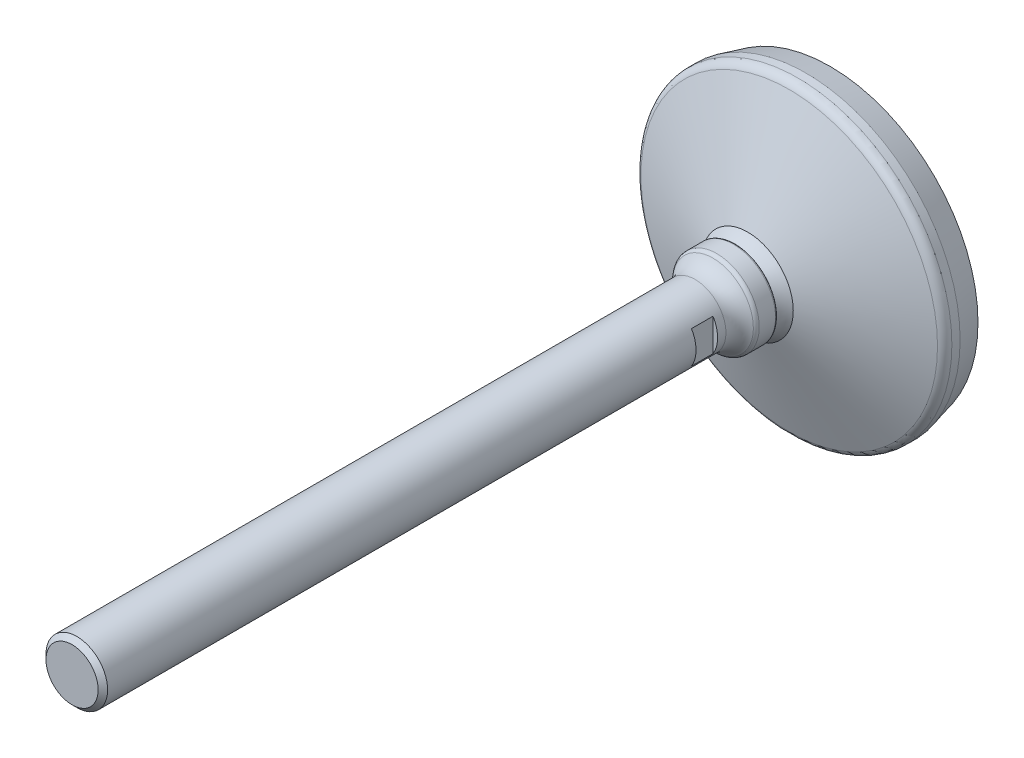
ISO-10303-21;
HEADER;
FILE_DESCRIPTION(('STEP AP214'),'2;1');
FILE_NAME('part.step','',(''),(''),'','','');
FILE_SCHEMA(('AUTOMOTIVE_DESIGN { 1 0 10303 214 1 1 1 1 }'));
ENDSEC;
DATA;
#1=APPLICATION_CONTEXT('core data for automotive mechanical design processes');
#2=APPLICATION_PROTOCOL_DEFINITION('international standard','automotive_design',2000,#1);
#3=PRODUCT_CONTEXT('',#1,'mechanical');
#4=PRODUCT('Part','Part','',(#3));
#5=PRODUCT_RELATED_PRODUCT_CATEGORY('part','',(#4));
#6=PRODUCT_DEFINITION_FORMATION('','',#4);
#7=PRODUCT_DEFINITION_CONTEXT('part definition',#1,'design');
#8=PRODUCT_DEFINITION('design','',#6,#7);
#9=PRODUCT_DEFINITION_SHAPE('','',#8);
#10=(LENGTH_UNIT() NAMED_UNIT(*) SI_UNIT(.MILLI.,.METRE.));
#11=(NAMED_UNIT(*) PLANE_ANGLE_UNIT() SI_UNIT($,.RADIAN.));
#12=(NAMED_UNIT(*) SI_UNIT($,.STERADIAN.) SOLID_ANGLE_UNIT());
#13=UNCERTAINTY_MEASURE_WITH_UNIT(LENGTH_MEASURE(1.E-05),#10,'distance_accuracy_value','');
#14=(GEOMETRIC_REPRESENTATION_CONTEXT(3) GLOBAL_UNCERTAINTY_ASSIGNED_CONTEXT((#13)) GLOBAL_UNIT_ASSIGNED_CONTEXT((#10,
#11,#12)) REPRESENTATION_CONTEXT('',''));
#15=CARTESIAN_POINT('',(0.,0.,0.));
#16=DIRECTION('',(0.,0.,1.));
#17=DIRECTION('',(1.,0.,0.));
#18=AXIS2_PLACEMENT_3D('',#15,#16,#17);
#19=CARTESIAN_POINT('',(0.,0.,35.3578436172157));
#20=DIRECTION('',(0.,0.,-1.));
#21=DIRECTION('',(1.,0.,0.));
#22=AXIS2_PLACEMENT_3D('',#19,#20,#21);
#23=TOROIDAL_SURFACE('',#22,23.0591361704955,12.);
#24=CARTESIAN_POINT('',(0.,0.,26.7));
#25=DIRECTION('',(0.,0.,-1.));
#26=DIRECTION('',(1.,0.,0.));
#27=AXIS2_PLACEMENT_3D('',#24,#25,#26);
#28=CIRCLE('',#27,14.75);
#29=CARTESIAN_POINT('',(14.75,0.,26.7));
#30=VERTEX_POINT('',#29);
#31=EDGE_CURVE('E86',#30,#30,#28,.T.);
#32=ORIENTED_EDGE('',*,*,#31,.F.);
#33=EDGE_LOOP('',(#32));
#34=FACE_BOUND('',#33,.T.);
#35=CARTESIAN_POINT('',(0.,0.,30.7));
#36=DIRECTION('',(0.,0.,-1.));
#37=DIRECTION('',(1.,0.,0.));
#38=AXIS2_PLACEMENT_3D('',#35,#36,#37);
#39=CIRCLE('',#38,12.);
#40=CARTESIAN_POINT('',(12.,0.,30.7));
#41=VERTEX_POINT('',#40);
#42=EDGE_CURVE('E61',#41,#41,#39,.T.);
#43=ORIENTED_EDGE('',*,*,#42,.T.);
#44=EDGE_LOOP('',(#43));
#45=FACE_BOUND('',#44,.T.);
#46=ADVANCED_FACE('F14',(#34,#45),#23,.F.);
#47=CARTESIAN_POINT('',(0.,0.,26.7));
#48=DIRECTION('',(0.,0.,-1.));
#49=DIRECTION('',(1.,0.,0.));
#50=AXIS2_PLACEMENT_3D('',#47,#48,#49);
#51=CONICAL_SURFACE('',#50,14.75,1.18784675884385);
#52=CARTESIAN_POINT('',(0.,0.,13.2569409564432));
#53=DIRECTION('',(0.,0.,-1.));
#54=DIRECTION('',(1.,0.,0.));
#55=AXIS2_PLACEMENT_3D('',#52,#53,#54);
#56=CIRCLE('',#55,48.1209740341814);
#57=CARTESIAN_POINT('',(48.1209740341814,0.,13.2569409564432));
#58=VERTEX_POINT('',#57);
#59=EDGE_CURVE('E89',#58,#58,#56,.T.);
#60=CARTESIAN_POINT('',(48.1209740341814,0.,13.2569409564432));
#61=CARTESIAN_POINT('',(47.7733597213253,0.,13.3969728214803));
#62=CARTESIAN_POINT('',(47.4257454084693,0.,13.5370046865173));
#63=CARTESIAN_POINT('',(46.7305167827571,0.,13.8170684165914));
#64=CARTESIAN_POINT('',(46.3829024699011,0.,13.9571002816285));
#65=CARTESIAN_POINT('',(45.687673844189,0.,14.2371640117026));
#66=CARTESIAN_POINT('',(45.3400595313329,0.,14.3771958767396));
#67=CARTESIAN_POINT('',(44.6448309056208,0.,14.6572596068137));
#68=CARTESIAN_POINT('',(44.2972165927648,0.,14.7972914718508));
#69=CARTESIAN_POINT('',(43.6019879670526,0.,15.0773552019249));
#70=CARTESIAN_POINT('',(43.2543736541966,0.,15.2173870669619));
#71=CARTESIAN_POINT('',(42.5591450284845,0.,15.497450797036));
#72=CARTESIAN_POINT('',(42.2115307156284,0.,15.6374826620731));
#73=CARTESIAN_POINT('',(41.5163020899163,0.,15.9175463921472));
#74=CARTESIAN_POINT('',(41.1686877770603,0.,16.0575782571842));
#75=CARTESIAN_POINT('',(40.4734591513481,0.,16.3376419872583));
#76=CARTESIAN_POINT('',(40.1258448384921,0.,16.4776738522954));
#77=CARTESIAN_POINT('',(39.43061621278,0.,16.7577375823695));
#78=CARTESIAN_POINT('',(39.0830018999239,0.,16.8977694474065));
#79=CARTESIAN_POINT('',(38.3877732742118,0.,17.1778331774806));
#80=CARTESIAN_POINT('',(38.0401589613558,0.,17.3178650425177));
#81=CARTESIAN_POINT('',(37.3449303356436,0.,17.5979287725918));
#82=CARTESIAN_POINT('',(36.9973160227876,0.,17.7379606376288));
#83=CARTESIAN_POINT('',(36.3020873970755,0.,18.0180243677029));
#84=CARTESIAN_POINT('',(35.9544730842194,0.,18.15805623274));
#85=CARTESIAN_POINT('',(35.2592444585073,0.,18.4381199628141));
#86=CARTESIAN_POINT('',(34.9116301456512,0.,18.5781518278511));
#87=CARTESIAN_POINT('',(34.2164015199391,0.,18.8582155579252));
#88=CARTESIAN_POINT('',(33.8687872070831,0.,18.9982474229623));
#89=CARTESIAN_POINT('',(33.173558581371,0.,19.2783111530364));
#90=CARTESIAN_POINT('',(32.8259442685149,0.,19.4183430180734));
#91=CARTESIAN_POINT('',(32.1307156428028,0.,19.6984067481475));
#92=CARTESIAN_POINT('',(31.7831013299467,0.,19.8384386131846));
#93=CARTESIAN_POINT('',(31.0878727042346,0.,20.1185023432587));
#94=CARTESIAN_POINT('',(30.7402583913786,0.,20.2585342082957));
#95=CARTESIAN_POINT('',(30.0450297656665,0.,20.5385979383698));
#96=CARTESIAN_POINT('',(29.6974154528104,0.,20.6786298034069));
#97=CARTESIAN_POINT('',(29.0021868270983,0.,20.958693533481));
#98=CARTESIAN_POINT('',(28.6545725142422,0.,21.098725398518));
#99=CARTESIAN_POINT('',(27.9593438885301,0.,21.3787891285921));
#100=CARTESIAN_POINT('',(27.6117295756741,0.,21.5188209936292));
#101=CARTESIAN_POINT('',(26.916500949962,0.,21.7988847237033));
#102=CARTESIAN_POINT('',(26.5688866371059,0.,21.9389165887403));
#103=CARTESIAN_POINT('',(25.8736580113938,0.,22.2189803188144));
#104=CARTESIAN_POINT('',(25.5260436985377,0.,22.3590121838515));
#105=CARTESIAN_POINT('',(24.8308150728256,0.,22.6390759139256));
#106=CARTESIAN_POINT('',(24.4832007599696,0.,22.7791077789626));
#107=CARTESIAN_POINT('',(23.7879721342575,0.,23.0591715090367));
#108=CARTESIAN_POINT('',(23.4403578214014,0.,23.1992033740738));
#109=CARTESIAN_POINT('',(22.7451291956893,0.,23.4792671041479));
#110=CARTESIAN_POINT('',(22.3975148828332,0.,23.6192989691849));
#111=CARTESIAN_POINT('',(21.7022862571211,0.,23.899362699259));
#112=CARTESIAN_POINT('',(21.3546719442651,0.,24.0393945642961));
#113=CARTESIAN_POINT('',(20.6594433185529,0.,24.3194582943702));
#114=CARTESIAN_POINT('',(20.3118290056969,0.,24.4594901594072));
#115=CARTESIAN_POINT('',(19.6166003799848,0.,24.7395538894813));
#116=CARTESIAN_POINT('',(19.2689860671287,0.,24.8795857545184));
#117=CARTESIAN_POINT('',(18.5737574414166,0.,25.1596494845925));
#118=CARTESIAN_POINT('',(18.2261431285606,0.,25.2996813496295));
#119=CARTESIAN_POINT('',(17.5309145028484,0.,25.5797450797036));
#120=CARTESIAN_POINT('',(17.1833001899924,0.,25.7197769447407));
#121=CARTESIAN_POINT('',(16.4880715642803,0.,25.9998406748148));
#122=CARTESIAN_POINT('',(16.1404572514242,0.,26.1398725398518));
#123=CARTESIAN_POINT('',(15.4452286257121,0.,26.4199362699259));
#124=CARTESIAN_POINT('',(15.0976143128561,0.,26.559968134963));
#125=CARTESIAN_POINT('',(14.75,0.,26.7));
#126=B_SPLINE_CURVE_WITH_KNOTS('',3,(#60,#61,#62,#63,#64,#65,#66,#67,#68,#69,#70,#71,#72,#73,
#74,#75,#76,#77,#78,#79,#80,#81,#82,#83,#84,#85,#86,#87,#88,#89,#90,#91,#92,#93,#94,#95,#96,#97,
#98,#99,#100,#101,#102,#103,#104,#105,#106,#107,#108,#109,#110,#111,#112,#113,#114,#115,#116,
#117,#118,#119,#120,#121,#122,#123,#124,#125),.UNSPECIFIED.,.F.,.F.,(4,2,2,2,2,2,2,2,2,2,2,2,2,
2,2,2,2,2,2,2,2,2,2,2,2,2,2,2,2,2,2,2,4),(0.,1.12427830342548,2.24855660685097,3.37283491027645,
4.49711321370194,5.62139151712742,6.7456698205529,7.86994812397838,8.99422642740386,
10.1185047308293,11.2427830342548,12.3670613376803,13.4913396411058,14.6156179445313,
15.7398962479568,16.8641745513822,17.9884528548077,19.1127311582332,20.2370094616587,
21.3612877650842,22.4855660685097,23.6098443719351,24.7341226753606,25.8584009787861,
26.9826792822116,28.1069575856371,29.2312358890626,30.3555141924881,31.4797924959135,
32.604070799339,33.7283491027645,34.85262740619,35.9769057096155),.UNSPECIFIED.);
#127=EDGE_CURVE('BSEAM147',#58,#30,#126,.T.);
#128=ORIENTED_EDGE('',*,*,#59,.F.);
#129=ORIENTED_EDGE('',*,*,#31,.T.);
#130=ORIENTED_EDGE('',*,*,#127,.T.);
#131=ORIENTED_EDGE('',*,*,#127,.F.);
#132=EDGE_LOOP('',(#128,#130,#129,#131));
#133=FACE_BOUND('',#132,.T.);
#134=ADVANCED_FACE('F147',(#133),#51,.T.);
#135=CARTESIAN_POINT('',(0.,0.,10.4742413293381));
#136=DIRECTION('',(0.,0.,-1.));
#137=DIRECTION('',(1.,0.,0.));
#138=AXIS2_PLACEMENT_3D('',#135,#136,#137);
#139=TOROIDAL_SURFACE('',#138,47.,3.);
#140=ORIENTED_EDGE('',*,*,#59,.T.);
#141=EDGE_LOOP('',(#140));
#142=FACE_BOUND('',#141,.T.);
#143=CARTESIAN_POINT('',(0.,0.,10.4742413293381));
#144=DIRECTION('',(0.,0.,-1.));
#145=DIRECTION('',(1.,0.,0.));
#146=AXIS2_PLACEMENT_3D('',#143,#144,#145);
#147=CIRCLE('',#146,50.);
#148=CARTESIAN_POINT('',(50.,0.,10.4742413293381));
#149=VERTEX_POINT('',#148);
#150=EDGE_CURVE('E92',#149,#149,#147,.T.);
#151=ORIENTED_EDGE('',*,*,#150,.F.);
#152=EDGE_LOOP('',(#151));
#153=FACE_BOUND('',#152,.T.);
#154=ADVANCED_FACE('F153',(#142,#153),#139,.T.);
#155=CARTESIAN_POINT('',(0.,0.,0.));
#156=DIRECTION('',(0.,0.,-1.));
#157=DIRECTION('',(1.,0.,0.));
#158=AXIS2_PLACEMENT_3D('',#155,#156,#157);
#159=CYLINDRICAL_SURFACE('',#158,50.);
#160=CARTESIAN_POINT('',(0.,0.,7.8));
#161=DIRECTION('',(0.,0.,-1.));
#162=DIRECTION('',(1.,0.,0.));
#163=AXIS2_PLACEMENT_3D('',#160,#161,#162);
#164=CIRCLE('',#163,50.);
#165=CARTESIAN_POINT('',(50.,0.,7.8));
#166=VERTEX_POINT('',#165);
#167=EDGE_CURVE('E95',#166,#166,#164,.T.);
#168=ORIENTED_EDGE('',*,*,#167,.F.);
#169=EDGE_LOOP('',(#168));
#170=FACE_BOUND('',#169,.T.);
#171=ORIENTED_EDGE('',*,*,#150,.T.);
#172=EDGE_LOOP('',(#171));
#173=FACE_BOUND('',#172,.T.);
#174=ADVANCED_FACE('F198',(#170,#173),#159,.T.);
#175=CARTESIAN_POINT('',(0.,0.,7.8));
#176=DIRECTION('',(0.,0.,1.));
#177=DIRECTION('',(-1.,0.,0.));
#178=AXIS2_PLACEMENT_3D('',#175,#176,#177);
#179=CONICAL_SURFACE('',#178,50.,0.251002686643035);
#180=CARTESIAN_POINT('',(0.,0.,0.));
#181=DIRECTION('',(0.,0.,-1.));
#182=DIRECTION('',(1.,0.,0.));
#183=AXIS2_PLACEMENT_3D('',#180,#181,#182);
#184=CIRCLE('',#183,48.);
#185=CARTESIAN_POINT('',(48.,0.,0.));
#186=VERTEX_POINT('',#185);
#187=EDGE_CURVE('E98',#186,#186,#184,.T.);
#188=ORIENTED_EDGE('',*,*,#187,.F.);
#189=EDGE_LOOP('',(#188));
#190=FACE_BOUND('',#189,.T.);
#191=ORIENTED_EDGE('',*,*,#167,.T.);
#192=EDGE_LOOP('',(#191));
#193=FACE_BOUND('',#192,.T.);
#194=ADVANCED_FACE('F194',(#190,#193),#179,.T.);
#195=CARTESIAN_POINT('',(48.,0.,0.));
#196=DIRECTION('',(0.,0.,1.));
#197=DIRECTION('',(-1.,0.,0.));
#198=AXIS2_PLACEMENT_3D('',#195,#196,#197);
#199=PLANE('',#198);
#200=ORIENTED_EDGE('',*,*,#187,.T.);
#201=EDGE_LOOP('',(#200));
#202=FACE_BOUND('',#201,.T.);
#203=ADVANCED_FACE('F187',(#202),#199,.F.);
#204=CARTESIAN_POINT('',(0.,0.,14.));
#205=DIRECTION('',(0.,0.,-1.));
#206=DIRECTION('',(0.,1.,0.));
#207=AXIS2_PLACEMENT_3D('',#204,#205,#206);
#208=CYLINDRICAL_SURFACE('',#207,10.);
#209=CARTESIAN_POINT('',(0.,0.,43.8));
#210=DIRECTION('',(0.,0.,-1.));
#211=DIRECTION('',(0.,1.,0.));
#212=AXIS2_PLACEMENT_3D('',#209,#210,#211);
#213=CIRCLE('',#212,10.);
#214=CARTESIAN_POINT('',(0.,10.,43.8));
#215=VERTEX_POINT('',#214);
#216=EDGE_CURVE('E107',#215,#215,#213,.T.);
#217=ORIENTED_EDGE('',*,*,#216,.F.);
#218=EDGE_LOOP('',(#217));
#219=FACE_BOUND('',#218,.T.);
#220=DIRECTION('',(0.,0.,-1.));
#221=VECTOR('',#220,1.);
#222=CARTESIAN_POINT('',(8.5,-5.26782687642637,14.));
#223=LINE('',#222,#221);
#224=CARTESIAN_POINT('',(8.5,-5.26782687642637,46.5));
#225=VERTEX_POINT('',#224);
#226=CARTESIAN_POINT('',(8.5,-5.26782687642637,53.5));
#227=VERTEX_POINT('',#226);
#228=EDGE_CURVE('E77',#225,#227,#223,.F.);
#229=ORIENTED_EDGE('',*,*,#228,.T.);
#230=CARTESIAN_POINT('',(0.,0.,53.5));
#231=DIRECTION('',(0.,0.,1.));
#232=DIRECTION('',(0.,-1.,0.));
#233=AXIS2_PLACEMENT_3D('',#230,#231,#232);
#234=CIRCLE('',#233,10.);
#235=CARTESIAN_POINT('',(8.5,5.26782687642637,53.5));
#236=VERTEX_POINT('',#235);
#237=EDGE_CURVE('E9',#227,#236,#234,.T.);
#238=ORIENTED_EDGE('',*,*,#237,.T.);
#239=DIRECTION('',(0.,0.,-1.));
#240=VECTOR('',#239,1.);
#241=CARTESIAN_POINT('',(8.5,5.26782687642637,14.));
#242=LINE('',#241,#240);
#243=CARTESIAN_POINT('',(8.5,5.26782687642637,46.5));
#244=VERTEX_POINT('',#243);
#245=EDGE_CURVE('E17',#236,#244,#242,.T.);
#246=ORIENTED_EDGE('',*,*,#245,.T.);
#247=CARTESIAN_POINT('',(0.,0.,46.5));
#248=DIRECTION('',(0.,0.,1.));
#249=DIRECTION('',(0.,-1.,0.));
#250=AXIS2_PLACEMENT_3D('',#247,#248,#249);
#251=CIRCLE('',#250,10.);
#252=EDGE_CURVE('E63',#225,#244,#251,.T.);
#253=ORIENTED_EDGE('',*,*,#252,.F.);
#254=EDGE_LOOP('',(#229,#238,#246,#253));
#255=FACE_BOUND('',#254,.T.);
#256=DIRECTION('',(0.,0.,-1.));
#257=VECTOR('',#256,1.);
#258=CARTESIAN_POINT('',(-8.5,5.26782687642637,14.));
#259=LINE('',#258,#257);
#260=CARTESIAN_POINT('',(-8.5,5.26782687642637,46.5));
#261=VERTEX_POINT('',#260);
#262=CARTESIAN_POINT('',(-8.5,5.26782687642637,53.5));
#263=VERTEX_POINT('',#262);
#264=EDGE_CURVE('E60',#261,#263,#259,.F.);
#265=ORIENTED_EDGE('',*,*,#264,.T.);
#266=CARTESIAN_POINT('',(-8.5,-5.26782687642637,53.5));
#267=VERTEX_POINT('',#266);
#268=EDGE_CURVE('E23',#263,#267,#234,.T.);
#269=ORIENTED_EDGE('',*,*,#268,.T.);
#270=DIRECTION('',(0.,0.,-1.));
#271=VECTOR('',#270,1.);
#272=CARTESIAN_POINT('',(-8.5,-5.26782687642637,14.));
#273=LINE('',#272,#271);
#274=CARTESIAN_POINT('',(-8.5,-5.26782687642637,46.5));
#275=VERTEX_POINT('',#274);
#276=EDGE_CURVE('E67',#267,#275,#273,.T.);
#277=ORIENTED_EDGE('',*,*,#276,.T.);
#278=EDGE_CURVE('E55',#261,#275,#251,.T.);
#279=ORIENTED_EDGE('',*,*,#278,.F.);
#280=EDGE_LOOP('',(#265,#269,#277,#279));
#281=FACE_BOUND('',#280,.T.);
#282=CARTESIAN_POINT('',(0.,0.,244.4665));
#283=DIRECTION('',(0.,0.,-1.));
#284=DIRECTION('',(0.,1.,0.));
#285=AXIS2_PLACEMENT_3D('',#282,#283,#284);
#286=CIRCLE('',#285,10.);
#287=CARTESIAN_POINT('',(0.,10.,244.4665));
#288=VERTEX_POINT('',#287);
#289=EDGE_CURVE('E104',#288,#288,#286,.T.);
#290=ORIENTED_EDGE('',*,*,#289,.T.);
#291=EDGE_LOOP('',(#290));
#292=FACE_BOUND('',#291,.T.);
#293=ADVANCED_FACE('F73',(#219,#255,#281,#292),#208,.T.);
#294=CARTESIAN_POINT('',(0.,0.,43.8));
#295=DIRECTION('',(0.,0.,-1.));
#296=DIRECTION('',(0.,1.,0.));
#297=AXIS2_PLACEMENT_3D('',#294,#295,#296);
#298=TOROIDAL_SURFACE('',#297,17.,7.);
#299=CARTESIAN_POINT('',(0.,0.,37.9949938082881));
#300=DIRECTION('',(0.,0.,-1.));
#301=DIRECTION('',(0.,1.,0.));
#302=AXIS2_PLACEMENT_3D('',#299,#300,#301);
#303=CIRCLE('',#302,13.0882352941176);
#304=CARTESIAN_POINT('',(0.,13.0882352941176,37.9949938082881));
#305=VERTEX_POINT('',#304);
#306=EDGE_CURVE('E110',#305,#305,#303,.T.);
#307=ORIENTED_EDGE('',*,*,#306,.F.);
#308=EDGE_LOOP('',(#307));
#309=FACE_BOUND('',#308,.T.);
#310=ORIENTED_EDGE('',*,*,#216,.T.);
#311=EDGE_LOOP('',(#310));
#312=FACE_BOUND('',#311,.T.);
#313=ADVANCED_FACE('F180',(#309,#312),#298,.F.);
#314=CARTESIAN_POINT('',(0.,0.,36.7510639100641));
#315=DIRECTION('',(0.,0.,-1.));
#316=DIRECTION('',(0.,1.,0.));
#317=AXIS2_PLACEMENT_3D('',#314,#315,#316);
#318=TOROIDAL_SURFACE('',#317,12.25,1.5);
#319=ORIENTED_EDGE('',*,*,#306,.T.);
#320=EDGE_LOOP('',(#319));
#321=FACE_BOUND('',#320,.T.);
#322=CARTESIAN_POINT('',(0.,0.,36.7510639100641));
#323=DIRECTION('',(0.,0.,-1.));
#324=DIRECTION('',(0.,1.,0.));
#325=AXIS2_PLACEMENT_3D('',#322,#323,#324);
#326=CIRCLE('',#325,13.75);
#327=CARTESIAN_POINT('',(0.,13.75,36.7510639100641));
#328=VERTEX_POINT('',#327);
#329=EDGE_CURVE('E113',#328,#328,#326,.T.);
#330=ORIENTED_EDGE('',*,*,#329,.F.);
#331=EDGE_LOOP('',(#330));
#332=FACE_BOUND('',#331,.T.);
#333=ADVANCED_FACE('F173',(#321,#332),#318,.T.);
#334=CARTESIAN_POINT('',(0.,0.,14.));
#335=DIRECTION('',(0.,0.,-1.));
#336=DIRECTION('',(0.,1.,0.));
#337=AXIS2_PLACEMENT_3D('',#334,#335,#336);
#338=CYLINDRICAL_SURFACE('',#337,13.75);
#339=CARTESIAN_POINT('',(0.,0.,31.45));
#340=DIRECTION('',(0.,0.,-1.));
#341=DIRECTION('',(0.,1.,0.));
#342=AXIS2_PLACEMENT_3D('',#339,#340,#341);
#343=CIRCLE('',#342,13.75);
#344=CARTESIAN_POINT('',(0.,13.75,31.45));
#345=VERTEX_POINT('',#344);
#346=EDGE_CURVE('E116',#345,#345,#343,.T.);
#347=ORIENTED_EDGE('',*,*,#346,.F.);
#348=EDGE_LOOP('',(#347));
#349=FACE_BOUND('',#348,.T.);
#350=ORIENTED_EDGE('',*,*,#329,.T.);
#351=EDGE_LOOP('',(#350));
#352=FACE_BOUND('',#351,.T.);
#353=ADVANCED_FACE('F166',(#349,#352),#338,.T.);
#354=CARTESIAN_POINT('',(0.,0.,31.45));
#355=DIRECTION('',(0.,0.,-1.));
#356=DIRECTION('',(0.,1.,0.));
#357=AXIS2_PLACEMENT_3D('',#354,#355,#356);
#358=TOROIDAL_SURFACE('',#357,13.,0.75);
#359=ORIENTED_EDGE('',*,*,#346,.T.);
#360=EDGE_LOOP('',(#359));
#361=FACE_BOUND('',#360,.T.);
#362=CARTESIAN_POINT('',(0.,0.,30.7));
#363=DIRECTION('',(0.,0.,-1.));
#364=DIRECTION('',(0.,1.,0.));
#365=AXIS2_PLACEMENT_3D('',#362,#363,#364);
#366=CIRCLE('',#365,13.);
#367=CARTESIAN_POINT('',(0.,13.,30.7));
#368=VERTEX_POINT('',#367);
#369=EDGE_CURVE('E119',#368,#368,#366,.T.);
#370=ORIENTED_EDGE('',*,*,#369,.F.);
#371=EDGE_LOOP('',(#370));
#372=FACE_BOUND('',#371,.T.);
#373=ADVANCED_FACE('F161',(#361,#372),#358,.T.);
#374=CARTESIAN_POINT('',(13.,0.,30.7));
#375=DIRECTION('',(0.,0.,1.));
#376=DIRECTION('',(0.,-1.,0.));
#377=AXIS2_PLACEMENT_3D('',#374,#375,#376);
#378=PLANE('',#377);
#379=ORIENTED_EDGE('',*,*,#42,.F.);
#380=EDGE_LOOP('',(#379));
#381=FACE_BOUND('',#380,.T.);
#382=ORIENTED_EDGE('',*,*,#369,.T.);
#383=EDGE_LOOP('',(#382));
#384=FACE_BOUND('',#383,.T.);
#385=ADVANCED_FACE('F145',(#381,#384),#378,.F.);
#386=CARTESIAN_POINT('',(0.,0.,46.5));
#387=DIRECTION('',(0.,0.,1.));
#388=DIRECTION('',(0.,-1.,0.));
#389=AXIS2_PLACEMENT_3D('',#386,#387,#388);
#390=PLANE('',#389);
#391=ORIENTED_EDGE('',*,*,#278,.T.);
#392=DIRECTION('',(0.,-1.,0.));
#393=VECTOR('',#392,1.);
#394=CARTESIAN_POINT('',(-8.5,20.,46.5));
#395=LINE('',#394,#393);
#396=EDGE_CURVE('E29',#261,#275,#395,.T.);
#397=ORIENTED_EDGE('',*,*,#396,.F.);
#398=EDGE_LOOP('',(#391,#397));
#399=FACE_BOUND('',#398,.T.);
#400=ADVANCED_FACE('F56',(#399),#390,.T.);
#401=CARTESIAN_POINT('',(0.,0.,53.5));
#402=DIRECTION('',(0.,0.,1.));
#403=DIRECTION('',(0.,-1.,0.));
#404=AXIS2_PLACEMENT_3D('',#401,#402,#403);
#405=PLANE('',#404);
#406=DIRECTION('',(0.,-1.,0.));
#407=VECTOR('',#406,1.);
#408=CARTESIAN_POINT('',(-8.5,20.,53.5));
#409=LINE('',#408,#407);
#410=EDGE_CURVE('E121',#263,#267,#409,.T.);
#411=ORIENTED_EDGE('',*,*,#410,.T.);
#412=ORIENTED_EDGE('',*,*,#268,.F.);
#413=EDGE_LOOP('',(#411,#412));
#414=FACE_BOUND('',#413,.T.);
#415=ADVANCED_FACE('F142',(#414),#405,.F.);
#416=CARTESIAN_POINT('',(-8.5,20.,53.5));
#417=DIRECTION('',(1.,0.,0.));
#418=DIRECTION('',(0.,1.,0.));
#419=AXIS2_PLACEMENT_3D('',#416,#417,#418);
#420=PLANE('',#419);
#421=ORIENTED_EDGE('',*,*,#410,.F.);
#422=ORIENTED_EDGE('',*,*,#264,.F.);
#423=ORIENTED_EDGE('',*,*,#396,.T.);
#424=ORIENTED_EDGE('',*,*,#276,.F.);
#425=EDGE_LOOP('',(#421,#422,#423,#424));
#426=FACE_BOUND('',#425,.T.);
#427=ADVANCED_FACE('F66',(#426),#420,.F.);
#428=CARTESIAN_POINT('',(8.5,-20.,53.5));
#429=DIRECTION('',(-1.,0.,0.));
#430=DIRECTION('',(0.,-1.,0.));
#431=AXIS2_PLACEMENT_3D('',#428,#429,#430);
#432=PLANE('',#431);
#433=DIRECTION('',(0.,1.,0.));
#434=VECTOR('',#433,1.);
#435=CARTESIAN_POINT('',(8.5,-20.,53.5));
#436=LINE('',#435,#434);
#437=EDGE_CURVE('E69',#227,#236,#436,.T.);
#438=ORIENTED_EDGE('',*,*,#437,.F.);
#439=ORIENTED_EDGE('',*,*,#228,.F.);
#440=DIRECTION('',(0.,1.,0.));
#441=VECTOR('',#440,1.);
#442=CARTESIAN_POINT('',(8.5,-20.,46.5));
#443=LINE('',#442,#441);
#444=EDGE_CURVE('E70',#225,#244,#443,.T.);
#445=ORIENTED_EDGE('',*,*,#444,.T.);
#446=ORIENTED_EDGE('',*,*,#245,.F.);
#447=EDGE_LOOP('',(#438,#439,#445,#446));
#448=FACE_BOUND('',#447,.T.);
#449=ADVANCED_FACE('F127',(#448),#432,.F.);
#450=ORIENTED_EDGE('',*,*,#437,.T.);
#451=ORIENTED_EDGE('',*,*,#237,.F.);
#452=EDGE_LOOP('',(#450,#451));
#453=FACE_BOUND('',#452,.T.);
#454=ADVANCED_FACE('F126',(#453),#405,.F.);
#455=ORIENTED_EDGE('',*,*,#444,.F.);
#456=ORIENTED_EDGE('',*,*,#252,.T.);
#457=EDGE_LOOP('',(#455,#456));
#458=FACE_BOUND('',#457,.T.);
#459=ADVANCED_FACE('F128',(#458),#390,.T.);
#460=CARTESIAN_POINT('',(0.,0.,246.));
#461=DIRECTION('',(0.,0.,-1.));
#462=DIRECTION('',(0.,1.,0.));
#463=AXIS2_PLACEMENT_3D('',#460,#461,#462);
#464=PLANE('',#463);
#465=CARTESIAN_POINT('',(0.,0.,246.));
#466=DIRECTION('',(0.,0.,-1.));
#467=DIRECTION('',(0.,1.,0.));
#468=AXIS2_PLACEMENT_3D('',#465,#466,#467);
#469=CIRCLE('',#468,8.4665);
#470=CARTESIAN_POINT('',(0.,8.4665,246.));
#471=VERTEX_POINT('',#470);
#472=EDGE_CURVE('E101',#471,#471,#469,.T.);
#473=ORIENTED_EDGE('',*,*,#472,.F.);
#474=EDGE_LOOP('',(#473));
#475=FACE_BOUND('',#474,.T.);
#476=ADVANCED_FACE('F130',(#475),#464,.F.);
#477=CARTESIAN_POINT('',(0.,0.,246.));
#478=DIRECTION('',(0.,0.,-1.));
#479=DIRECTION('',(0.,1.,0.));
#480=AXIS2_PLACEMENT_3D('',#477,#478,#479);
#481=CONICAL_SURFACE('',#480,8.4665,0.785398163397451);
#482=ORIENTED_EDGE('',*,*,#289,.F.);
#483=EDGE_LOOP('',(#482));
#484=FACE_BOUND('',#483,.T.);
#485=ORIENTED_EDGE('',*,*,#472,.T.);
#486=EDGE_LOOP('',(#485));
#487=FACE_BOUND('',#486,.T.);
#488=ADVANCED_FACE('F138',(#484,#487),#481,.T.);
#489=CLOSED_SHELL('',(#46,#134,#154,#174,#194,#203,#293,#313,#333,#353,#373,#385,#400,#415,#427,
#449,#454,#459,#476,#488));
#490=MANIFOLD_SOLID_BREP('B1',#489);
#491=ADVANCED_BREP_SHAPE_REPRESENTATION('',(#18,#490),#14);
#492=SHAPE_DEFINITION_REPRESENTATION(#9,#491);
ENDSEC;
END-ISO-10303-21;
